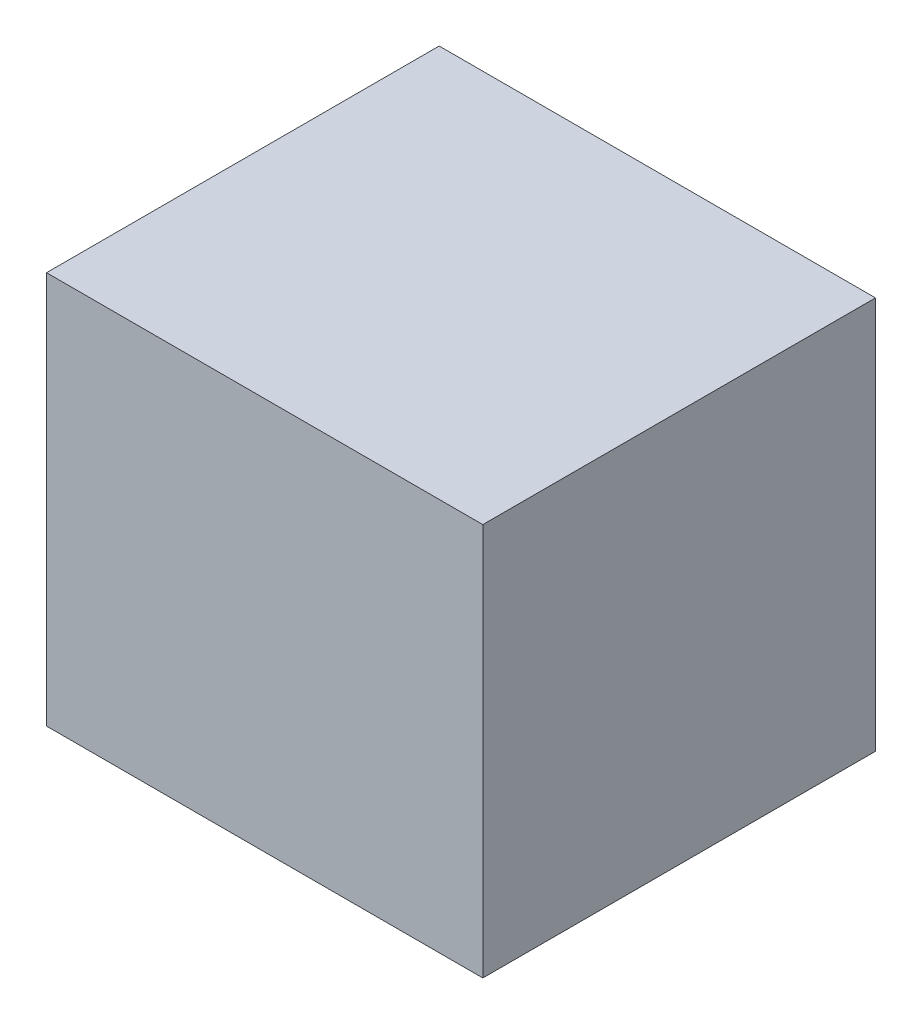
ISO-10303-21;
HEADER;
FILE_DESCRIPTION(('STEP AP214'),'2;1');
FILE_NAME('part.step','',(''),(''),'','','');
FILE_SCHEMA(('AUTOMOTIVE_DESIGN { 1 0 10303 214 1 1 1 1 }'));
ENDSEC;
DATA;
#1=APPLICATION_CONTEXT('core data for automotive mechanical design processes');
#2=APPLICATION_PROTOCOL_DEFINITION('international standard','automotive_design',2000,#1);
#3=PRODUCT_CONTEXT('',#1,'mechanical');
#4=PRODUCT('Part','Part','',(#3));
#5=PRODUCT_RELATED_PRODUCT_CATEGORY('part','',(#4));
#6=PRODUCT_DEFINITION_FORMATION('','',#4);
#7=PRODUCT_DEFINITION_CONTEXT('part definition',#1,'design');
#8=PRODUCT_DEFINITION('design','',#6,#7);
#9=PRODUCT_DEFINITION_SHAPE('','',#8);
#10=(LENGTH_UNIT() NAMED_UNIT(*) SI_UNIT(.MILLI.,.METRE.));
#11=(NAMED_UNIT(*) PLANE_ANGLE_UNIT() SI_UNIT($,.RADIAN.));
#12=(NAMED_UNIT(*) SI_UNIT($,.STERADIAN.) SOLID_ANGLE_UNIT());
#13=UNCERTAINTY_MEASURE_WITH_UNIT(LENGTH_MEASURE(1.E-05),#10,'distance_accuracy_value','');
#14=(GEOMETRIC_REPRESENTATION_CONTEXT(3) GLOBAL_UNCERTAINTY_ASSIGNED_CONTEXT((#13)) GLOBAL_UNIT_ASSIGNED_CONTEXT((#10,
#11,#12)) REPRESENTATION_CONTEXT('',''));
#15=CARTESIAN_POINT('',(0.,0.,0.));
#16=DIRECTION('',(0.,0.,1.));
#17=DIRECTION('',(1.,0.,0.));
#18=AXIS2_PLACEMENT_3D('',#15,#16,#17);
#19=CARTESIAN_POINT('',(0.,0.,0.4499991));
#20=DIRECTION('',(0.,0.,-1.));
#21=DIRECTION('',(0.,-1.,0.));
#22=AXIS2_PLACEMENT_3D('',#19,#20,#21);
#23=PLANE('',#22);
#24=DIRECTION('',(0.,-1.,0.));
#25=VECTOR('',#24,1.);
#26=CARTESIAN_POINT('',(0.2499995,0.22500082,0.4499991));
#27=LINE('',#26,#25);
#28=CARTESIAN_POINT('',(0.2499995,0.22500082,0.4499991));
#29=VERTEX_POINT('',#28);
#30=CARTESIAN_POINT('',(0.2499995,-0.22500082,0.4499991));
#31=VERTEX_POINT('',#30);
#32=EDGE_CURVE('E27',#29,#31,#27,.T.);
#33=ORIENTED_EDGE('',*,*,#32,.F.);
#34=DIRECTION('',(1.,0.,0.));
#35=VECTOR('',#34,1.);
#36=CARTESIAN_POINT('',(-0.2499995,0.22500082,0.4499991));
#37=LINE('',#36,#35);
#38=CARTESIAN_POINT('',(-0.2499995,0.22500082,0.4499991));
#39=VERTEX_POINT('',#38);
#40=EDGE_CURVE('E86',#39,#29,#37,.T.);
#41=ORIENTED_EDGE('',*,*,#40,.F.);
#42=DIRECTION('',(0.,1.,0.));
#43=VECTOR('',#42,1.);
#44=CARTESIAN_POINT('',(-0.2499995,-0.22500082,0.4499991));
#45=LINE('',#44,#43);
#46=CARTESIAN_POINT('',(-0.2499995,-0.22500082,0.4499991));
#47=VERTEX_POINT('',#46);
#48=EDGE_CURVE('E88',#47,#39,#45,.T.);
#49=ORIENTED_EDGE('',*,*,#48,.F.);
#50=DIRECTION('',(-1.,0.,0.));
#51=VECTOR('',#50,1.);
#52=CARTESIAN_POINT('',(0.2499995,-0.22500082,0.4499991));
#53=LINE('',#52,#51);
#54=EDGE_CURVE('E102',#31,#47,#53,.T.);
#55=ORIENTED_EDGE('',*,*,#54,.F.);
#56=EDGE_LOOP('',(#33,#41,#49,#55));
#57=FACE_BOUND('',#56,.T.);
#58=ADVANCED_FACE('F17',(#57),#23,.F.);
#59=CARTESIAN_POINT('',(0.,0.,0.));
#60=DIRECTION('',(0.,0.,-1.));
#61=DIRECTION('',(0.,-1.,0.));
#62=AXIS2_PLACEMENT_3D('',#59,#60,#61);
#63=PLANE('',#62);
#64=DIRECTION('',(-1.,0.,0.));
#65=VECTOR('',#64,1.);
#66=CARTESIAN_POINT('',(0.2499995,-0.22500082,0.));
#67=LINE('',#66,#65);
#68=CARTESIAN_POINT('',(0.2499995,-0.22500082,0.));
#69=VERTEX_POINT('',#68);
#70=CARTESIAN_POINT('',(-0.2499995,-0.22500082,0.));
#71=VERTEX_POINT('',#70);
#72=EDGE_CURVE('E81',#69,#71,#67,.T.);
#73=ORIENTED_EDGE('',*,*,#72,.T.);
#74=DIRECTION('',(0.,1.,0.));
#75=VECTOR('',#74,1.);
#76=CARTESIAN_POINT('',(-0.2499995,-0.22500082,0.));
#77=LINE('',#76,#75);
#78=CARTESIAN_POINT('',(-0.2499995,0.22500082,0.));
#79=VERTEX_POINT('',#78);
#80=EDGE_CURVE('E78',#71,#79,#77,.T.);
#81=ORIENTED_EDGE('',*,*,#80,.T.);
#82=DIRECTION('',(1.,0.,0.));
#83=VECTOR('',#82,1.);
#84=CARTESIAN_POINT('',(-0.2499995,0.22500082,0.));
#85=LINE('',#84,#83);
#86=CARTESIAN_POINT('',(0.2499995,0.22500082,0.));
#87=VERTEX_POINT('',#86);
#88=EDGE_CURVE('E67',#79,#87,#85,.T.);
#89=ORIENTED_EDGE('',*,*,#88,.T.);
#90=DIRECTION('',(0.,-1.,0.));
#91=VECTOR('',#90,1.);
#92=CARTESIAN_POINT('',(0.2499995,0.22500082,0.));
#93=LINE('',#92,#91);
#94=EDGE_CURVE('E11',#87,#69,#93,.T.);
#95=ORIENTED_EDGE('',*,*,#94,.T.);
#96=EDGE_LOOP('',(#73,#81,#89,#95));
#97=FACE_BOUND('',#96,.T.);
#98=ADVANCED_FACE('F79',(#97),#63,.T.);
#99=CARTESIAN_POINT('',(0.2499995,0.22500082,0.));
#100=DIRECTION('',(1.,0.,0.));
#101=DIRECTION('',(0.,1.,0.));
#102=AXIS2_PLACEMENT_3D('',#99,#100,#101);
#103=PLANE('',#102);
#104=DIRECTION('',(0.,0.,1.));
#105=VECTOR('',#104,1.);
#106=CARTESIAN_POINT('',(0.2499995,0.22500082,0.));
#107=LINE('',#106,#105);
#108=EDGE_CURVE('E20',#87,#29,#107,.T.);
#109=ORIENTED_EDGE('',*,*,#108,.T.);
#110=ORIENTED_EDGE('',*,*,#32,.T.);
#111=DIRECTION('',(0.,0.,1.));
#112=VECTOR('',#111,1.);
#113=CARTESIAN_POINT('',(0.2499995,-0.22500082,0.));
#114=LINE('',#113,#112);
#115=EDGE_CURVE('E108',#69,#31,#114,.T.);
#116=ORIENTED_EDGE('',*,*,#115,.F.);
#117=ORIENTED_EDGE('',*,*,#94,.F.);
#118=EDGE_LOOP('',(#109,#110,#116,#117));
#119=FACE_BOUND('',#118,.T.);
#120=ADVANCED_FACE('F118',(#119),#103,.T.);
#121=CARTESIAN_POINT('',(-0.2499995,0.22500082,0.));
#122=DIRECTION('',(0.,1.,0.));
#123=DIRECTION('',(1.,0.,0.));
#124=AXIS2_PLACEMENT_3D('',#121,#122,#123);
#125=PLANE('',#124);
#126=DIRECTION('',(0.,0.,1.));
#127=VECTOR('',#126,1.);
#128=CARTESIAN_POINT('',(-0.2499995,0.22500082,0.));
#129=LINE('',#128,#127);
#130=EDGE_CURVE('E72',#79,#39,#129,.T.);
#131=ORIENTED_EDGE('',*,*,#130,.T.);
#132=ORIENTED_EDGE('',*,*,#40,.T.);
#133=ORIENTED_EDGE('',*,*,#108,.F.);
#134=ORIENTED_EDGE('',*,*,#88,.F.);
#135=EDGE_LOOP('',(#131,#132,#133,#134));
#136=FACE_BOUND('',#135,.T.);
#137=ADVANCED_FACE('F69',(#136),#125,.T.);
#138=CARTESIAN_POINT('',(-0.2499995,-0.22500082,0.));
#139=DIRECTION('',(-1.,0.,0.));
#140=DIRECTION('',(0.,0.,1.));
#141=AXIS2_PLACEMENT_3D('',#138,#139,#140);
#142=PLANE('',#141);
#143=DIRECTION('',(0.,0.,1.));
#144=VECTOR('',#143,1.);
#145=CARTESIAN_POINT('',(-0.2499995,-0.22500082,0.));
#146=LINE('',#145,#144);
#147=EDGE_CURVE('E99',#71,#47,#146,.T.);
#148=ORIENTED_EDGE('',*,*,#147,.T.);
#149=ORIENTED_EDGE('',*,*,#48,.T.);
#150=ORIENTED_EDGE('',*,*,#130,.F.);
#151=ORIENTED_EDGE('',*,*,#80,.F.);
#152=EDGE_LOOP('',(#148,#149,#150,#151));
#153=FACE_BOUND('',#152,.T.);
#154=ADVANCED_FACE('F87',(#153),#142,.T.);
#155=CARTESIAN_POINT('',(0.2499995,-0.22500082,0.));
#156=DIRECTION('',(0.,-1.,0.));
#157=DIRECTION('',(0.,0.,-1.));
#158=AXIS2_PLACEMENT_3D('',#155,#156,#157);
#159=PLANE('',#158);
#160=ORIENTED_EDGE('',*,*,#115,.T.);
#161=ORIENTED_EDGE('',*,*,#54,.T.);
#162=ORIENTED_EDGE('',*,*,#147,.F.);
#163=ORIENTED_EDGE('',*,*,#72,.F.);
#164=EDGE_LOOP('',(#160,#161,#162,#163));
#165=FACE_BOUND('',#164,.T.);
#166=ADVANCED_FACE('F116',(#165),#159,.T.);
#167=CLOSED_SHELL('',(#58,#98,#120,#137,#154,#166));
#168=MANIFOLD_SOLID_BREP('B1',#167);
#169=ADVANCED_BREP_SHAPE_REPRESENTATION('',(#18,#168),#14);
#170=SHAPE_DEFINITION_REPRESENTATION(#9,#169);
ENDSEC;
END-ISO-10303-21;
